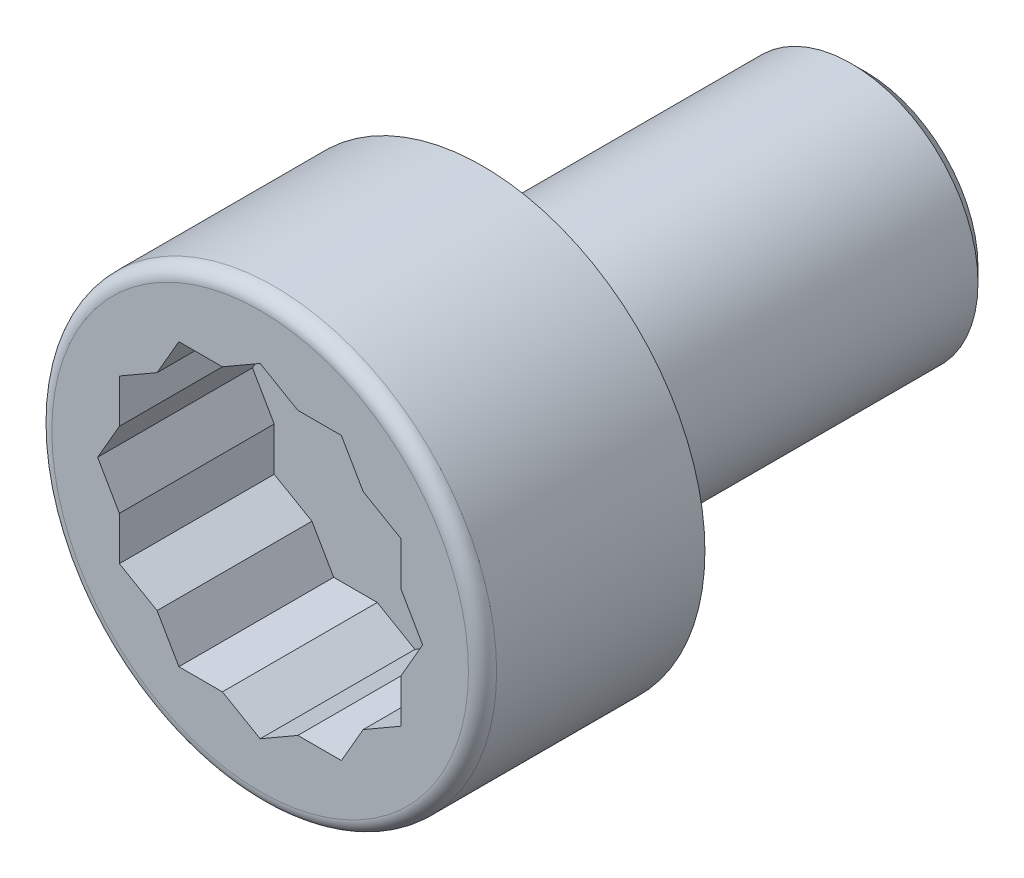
ISO-10303-21;
HEADER;
FILE_DESCRIPTION(('STEP AP214'),'2;1');
FILE_NAME('part.step','',(''),(''),'','','');
FILE_SCHEMA(('AUTOMOTIVE_DESIGN { 1 0 10303 214 1 1 1 1 }'));
ENDSEC;
DATA;
#1=APPLICATION_CONTEXT('core data for automotive mechanical design processes');
#2=APPLICATION_PROTOCOL_DEFINITION('international standard','automotive_design',2000,#1);
#3=PRODUCT_CONTEXT('',#1,'mechanical');
#4=PRODUCT('Part','Part','',(#3));
#5=PRODUCT_RELATED_PRODUCT_CATEGORY('part','',(#4));
#6=PRODUCT_DEFINITION_FORMATION('','',#4);
#7=PRODUCT_DEFINITION_CONTEXT('part definition',#1,'design');
#8=PRODUCT_DEFINITION('design','',#6,#7);
#9=PRODUCT_DEFINITION_SHAPE('','',#8);
#10=(LENGTH_UNIT() NAMED_UNIT(*) SI_UNIT(.MILLI.,.METRE.));
#11=(NAMED_UNIT(*) PLANE_ANGLE_UNIT() SI_UNIT($,.RADIAN.));
#12=(NAMED_UNIT(*) SI_UNIT($,.STERADIAN.) SOLID_ANGLE_UNIT());
#13=UNCERTAINTY_MEASURE_WITH_UNIT(LENGTH_MEASURE(1.E-05),#10,'distance_accuracy_value','');
#14=(GEOMETRIC_REPRESENTATION_CONTEXT(3) GLOBAL_UNCERTAINTY_ASSIGNED_CONTEXT((#13)) GLOBAL_UNIT_ASSIGNED_CONTEXT((#10,
#11,#12)) REPRESENTATION_CONTEXT('',''));
#15=CARTESIAN_POINT('',(0.,0.,0.));
#16=DIRECTION('',(0.,0.,1.));
#17=DIRECTION('',(1.,0.,0.));
#18=AXIS2_PLACEMENT_3D('',#15,#16,#17);
#19=CARTESIAN_POINT('',(5.,2.88675134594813,-5.5));
#20=DIRECTION('',(0.5,0.866025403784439,0.));
#21=DIRECTION('',(-0.866025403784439,0.5,0.));
#22=AXIS2_PLACEMENT_3D('',#19,#20,#21);
#23=PLANE('',#22);
#24=DIRECTION('',(-0.866025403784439,0.5,0.));
#25=VECTOR('',#24,1.);
#26=CARTESIAN_POINT('',(5.,2.88675134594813,-5.5));
#27=LINE('',#26,#25);
#28=CARTESIAN_POINT('',(1.3397459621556,5.,-5.5));
#29=VERTEX_POINT('',#28);
#30=CARTESIAN_POINT('',(0.,5.77350269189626,-5.5));
#31=VERTEX_POINT('',#30);
#32=EDGE_CURVE('E317',#29,#31,#27,.T.);
#33=ORIENTED_EDGE('',*,*,#32,.F.);
#34=DIRECTION('',(0.,0.,1.));
#35=VECTOR('',#34,1.);
#36=CARTESIAN_POINT('',(1.33974596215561,5.,-5.5));
#37=LINE('',#36,#35);
#38=CARTESIAN_POINT('',(1.33974596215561,5.,0.));
#39=VERTEX_POINT('',#38);
#40=EDGE_CURVE('E292',#29,#39,#37,.T.);
#41=ORIENTED_EDGE('',*,*,#40,.T.);
#42=DIRECTION('',(-0.866025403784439,0.5,0.));
#43=VECTOR('',#42,1.);
#44=CARTESIAN_POINT('',(5.,2.88675134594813,0.));
#45=LINE('',#44,#43);
#46=CARTESIAN_POINT('',(0.,5.77350269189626,0.));
#47=VERTEX_POINT('',#46);
#48=EDGE_CURVE('E295',#39,#47,#45,.T.);
#49=ORIENTED_EDGE('',*,*,#48,.T.);
#50=DIRECTION('',(0.,0.,1.));
#51=VECTOR('',#50,1.);
#52=CARTESIAN_POINT('',(0.,5.77350269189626,-5.5));
#53=LINE('',#52,#51);
#54=EDGE_CURVE('E341',#31,#47,#53,.T.);
#55=ORIENTED_EDGE('',*,*,#54,.F.);
#56=EDGE_LOOP('',(#33,#41,#49,#55));
#57=FACE_BOUND('',#56,.T.);
#58=ADVANCED_FACE('F31',(#57),#23,.F.);
#59=CARTESIAN_POINT('',(5.,-2.88675134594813,-5.5));
#60=DIRECTION('',(1.,0.,0.));
#61=DIRECTION('',(0.,1.,0.));
#62=AXIS2_PLACEMENT_3D('',#59,#60,#61);
#63=PLANE('',#62);
#64=DIRECTION('',(0.,1.,0.));
#65=VECTOR('',#64,1.);
#66=CARTESIAN_POINT('',(5.,-2.88675134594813,-5.5));
#67=LINE('',#66,#65);
#68=CARTESIAN_POINT('',(4.99999999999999,1.33974596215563,-5.5));
#69=VERTEX_POINT('',#68);
#70=CARTESIAN_POINT('',(5.,2.88675134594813,-5.5));
#71=VERTEX_POINT('',#70);
#72=EDGE_CURVE('E337',#69,#71,#67,.T.);
#73=ORIENTED_EDGE('',*,*,#72,.F.);
#74=DIRECTION('',(0.,0.,1.));
#75=VECTOR('',#74,1.);
#76=CARTESIAN_POINT('',(5.,1.33974596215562,-5.5));
#77=LINE('',#76,#75);
#78=CARTESIAN_POINT('',(5.,1.33974596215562,0.));
#79=VERTEX_POINT('',#78);
#80=EDGE_CURVE('E285',#69,#79,#77,.T.);
#81=ORIENTED_EDGE('',*,*,#80,.T.);
#82=DIRECTION('',(0.,1.,0.));
#83=VECTOR('',#82,1.);
#84=CARTESIAN_POINT('',(5.,-2.88675134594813,0.));
#85=LINE('',#84,#83);
#86=CARTESIAN_POINT('',(5.,2.88675134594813,0.));
#87=VERTEX_POINT('',#86);
#88=EDGE_CURVE('E313',#79,#87,#85,.T.);
#89=ORIENTED_EDGE('',*,*,#88,.T.);
#90=DIRECTION('',(0.,0.,1.));
#91=VECTOR('',#90,1.);
#92=CARTESIAN_POINT('',(5.,2.88675134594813,-5.5));
#93=LINE('',#92,#91);
#94=EDGE_CURVE('E342',#71,#87,#93,.T.);
#95=ORIENTED_EDGE('',*,*,#94,.F.);
#96=EDGE_LOOP('',(#73,#81,#89,#95));
#97=FACE_BOUND('',#96,.T.);
#98=ADVANCED_FACE('F390',(#97),#63,.F.);
#99=CARTESIAN_POINT('',(0.,-5.77350269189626,-5.5));
#100=DIRECTION('',(0.5,-0.866025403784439,0.));
#101=DIRECTION('',(0.866025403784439,0.5,0.));
#102=AXIS2_PLACEMENT_3D('',#99,#100,#101);
#103=PLANE('',#102);
#104=DIRECTION('',(0.866025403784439,0.5,0.));
#105=VECTOR('',#104,1.);
#106=CARTESIAN_POINT('',(0.,-5.77350269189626,-5.5));
#107=LINE('',#106,#105);
#108=CARTESIAN_POINT('',(3.66025403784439,-3.66025403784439,-5.5));
#109=VERTEX_POINT('',#108);
#110=CARTESIAN_POINT('',(5.,-2.88675134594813,-5.5));
#111=VERTEX_POINT('',#110);
#112=EDGE_CURVE('E333',#109,#111,#107,.T.);
#113=ORIENTED_EDGE('',*,*,#112,.F.);
#114=DIRECTION('',(0.,0.,1.));
#115=VECTOR('',#114,1.);
#116=CARTESIAN_POINT('',(3.66025403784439,-3.66025403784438,-5.5));
#117=LINE('',#116,#115);
#118=CARTESIAN_POINT('',(3.66025403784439,-3.66025403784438,0.));
#119=VERTEX_POINT('',#118);
#120=EDGE_CURVE('E279',#109,#119,#117,.T.);
#121=ORIENTED_EDGE('',*,*,#120,.T.);
#122=DIRECTION('',(0.866025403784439,0.5,0.));
#123=VECTOR('',#122,1.);
#124=CARTESIAN_POINT('',(0.,-5.77350269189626,0.));
#125=LINE('',#124,#123);
#126=CARTESIAN_POINT('',(5.,-2.88675134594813,0.));
#127=VERTEX_POINT('',#126);
#128=EDGE_CURVE('E309',#119,#127,#125,.T.);
#129=ORIENTED_EDGE('',*,*,#128,.T.);
#130=DIRECTION('',(0.,0.,1.));
#131=VECTOR('',#130,1.);
#132=CARTESIAN_POINT('',(5.,-2.88675134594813,-5.5));
#133=LINE('',#132,#131);
#134=EDGE_CURVE('E346',#111,#127,#133,.T.);
#135=ORIENTED_EDGE('',*,*,#134,.F.);
#136=EDGE_LOOP('',(#113,#121,#129,#135));
#137=FACE_BOUND('',#136,.T.);
#138=ADVANCED_FACE('F397',(#137),#103,.F.);
#139=CARTESIAN_POINT('',(-5.,-2.88675134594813,-5.5));
#140=DIRECTION('',(-0.5,-0.866025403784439,0.));
#141=DIRECTION('',(0.866025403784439,-0.5,0.));
#142=AXIS2_PLACEMENT_3D('',#139,#140,#141);
#143=PLANE('',#142);
#144=DIRECTION('',(0.866025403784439,-0.5,0.));
#145=VECTOR('',#144,1.);
#146=CARTESIAN_POINT('',(-5.,-2.88675134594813,-5.5));
#147=LINE('',#146,#145);
#148=CARTESIAN_POINT('',(-1.33974596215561,-5.,-5.5));
#149=VERTEX_POINT('',#148);
#150=CARTESIAN_POINT('',(0.,-5.77350269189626,-5.5));
#151=VERTEX_POINT('',#150);
#152=EDGE_CURVE('E329',#149,#151,#147,.T.);
#153=ORIENTED_EDGE('',*,*,#152,.F.);
#154=DIRECTION('',(0.,0.,1.));
#155=VECTOR('',#154,1.);
#156=CARTESIAN_POINT('',(-1.33974596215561,-5.,-5.5));
#157=LINE('',#156,#155);
#158=CARTESIAN_POINT('',(-1.33974596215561,-5.,0.));
#159=VERTEX_POINT('',#158);
#160=EDGE_CURVE('E273',#149,#159,#157,.T.);
#161=ORIENTED_EDGE('',*,*,#160,.T.);
#162=DIRECTION('',(0.866025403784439,-0.5,0.));
#163=VECTOR('',#162,1.);
#164=CARTESIAN_POINT('',(-5.,-2.88675134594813,0.));
#165=LINE('',#164,#163);
#166=CARTESIAN_POINT('',(0.,-5.77350269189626,0.));
#167=VERTEX_POINT('',#166);
#168=EDGE_CURVE('E305',#159,#167,#165,.T.);
#169=ORIENTED_EDGE('',*,*,#168,.T.);
#170=DIRECTION('',(0.,0.,1.));
#171=VECTOR('',#170,1.);
#172=CARTESIAN_POINT('',(0.,-5.77350269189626,-5.5));
#173=LINE('',#172,#171);
#174=EDGE_CURVE('E349',#151,#167,#173,.T.);
#175=ORIENTED_EDGE('',*,*,#174,.F.);
#176=EDGE_LOOP('',(#153,#161,#169,#175));
#177=FACE_BOUND('',#176,.T.);
#178=ADVANCED_FACE('F458',(#177),#143,.F.);
#179=CARTESIAN_POINT('',(-5.,2.88675134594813,-5.5));
#180=DIRECTION('',(-1.,0.,0.));
#181=DIRECTION('',(0.,-1.,0.));
#182=AXIS2_PLACEMENT_3D('',#179,#180,#181);
#183=PLANE('',#182);
#184=DIRECTION('',(0.,-1.,0.));
#185=VECTOR('',#184,1.);
#186=CARTESIAN_POINT('',(-5.,2.88675134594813,-5.5));
#187=LINE('',#186,#185);
#188=CARTESIAN_POINT('',(-5.,-1.33974596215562,-5.5));
#189=VERTEX_POINT('',#188);
#190=CARTESIAN_POINT('',(-5.,-2.88675134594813,-5.5));
#191=VERTEX_POINT('',#190);
#192=EDGE_CURVE('E325',#189,#191,#187,.T.);
#193=ORIENTED_EDGE('',*,*,#192,.F.);
#194=DIRECTION('',(0.,0.,1.));
#195=VECTOR('',#194,1.);
#196=CARTESIAN_POINT('',(-5.,-1.33974596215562,-5.5));
#197=LINE('',#196,#195);
#198=CARTESIAN_POINT('',(-5.,-1.33974596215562,0.));
#199=VERTEX_POINT('',#198);
#200=EDGE_CURVE('E267',#189,#199,#197,.T.);
#201=ORIENTED_EDGE('',*,*,#200,.T.);
#202=DIRECTION('',(0.,-1.,0.));
#203=VECTOR('',#202,1.);
#204=CARTESIAN_POINT('',(-5.,2.88675134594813,0.));
#205=LINE('',#204,#203);
#206=CARTESIAN_POINT('',(-5.,-2.88675134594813,0.));
#207=VERTEX_POINT('',#206);
#208=EDGE_CURVE('E301',#199,#207,#205,.T.);
#209=ORIENTED_EDGE('',*,*,#208,.T.);
#210=DIRECTION('',(0.,0.,1.));
#211=VECTOR('',#210,1.);
#212=CARTESIAN_POINT('',(-5.,-2.88675134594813,-5.5));
#213=LINE('',#212,#211);
#214=EDGE_CURVE('E352',#191,#207,#213,.T.);
#215=ORIENTED_EDGE('',*,*,#214,.F.);
#216=EDGE_LOOP('',(#193,#201,#209,#215));
#217=FACE_BOUND('',#216,.T.);
#218=ADVANCED_FACE('F476',(#217),#183,.F.);
#219=CARTESIAN_POINT('',(0.,5.77350269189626,-5.5));
#220=DIRECTION('',(-0.5,0.866025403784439,0.));
#221=DIRECTION('',(-0.866025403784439,-0.5,0.));
#222=AXIS2_PLACEMENT_3D('',#219,#220,#221);
#223=PLANE('',#222);
#224=DIRECTION('',(-0.866025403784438,-0.5,0.));
#225=VECTOR('',#224,1.);
#226=CARTESIAN_POINT('',(0.,5.77350269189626,0.));
#227=LINE('',#226,#225);
#228=CARTESIAN_POINT('',(-1.33974596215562,5.,0.));
#229=VERTEX_POINT('',#228);
#230=EDGE_CURVE('E299',#47,#229,#227,.T.);
#231=ORIENTED_EDGE('',*,*,#230,.T.);
#232=DIRECTION('',(0.,0.,-1.));
#233=VECTOR('',#232,1.);
#234=CARTESIAN_POINT('',(-1.33974596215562,5.,-5.5));
#235=LINE('',#234,#233);
#236=CARTESIAN_POINT('',(-1.33974596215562,5.,-5.5));
#237=VERTEX_POINT('',#236);
#238=EDGE_CURVE('E197',#229,#237,#235,.T.);
#239=ORIENTED_EDGE('',*,*,#238,.T.);
#240=DIRECTION('',(-0.866025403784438,-0.5,0.));
#241=VECTOR('',#240,1.);
#242=CARTESIAN_POINT('',(0.,5.77350269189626,-5.5));
#243=LINE('',#242,#241);
#244=EDGE_CURVE('E322',#31,#237,#243,.T.);
#245=ORIENTED_EDGE('',*,*,#244,.F.);
#246=ORIENTED_EDGE('',*,*,#54,.T.);
#247=EDGE_LOOP('',(#231,#239,#245,#246));
#248=FACE_BOUND('',#247,.T.);
#249=ADVANCED_FACE('F493',(#248),#223,.F.);
#250=CARTESIAN_POINT('',(0.,7.89999999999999,0.));
#251=DIRECTION('',(0.,0.,-1.));
#252=DIRECTION('',(-1.,0.,0.));
#253=AXIS2_PLACEMENT_3D('',#250,#251,#252);
#254=PLANE('',#253);
#255=CARTESIAN_POINT('',(0.,0.,0.));
#256=DIRECTION('',(0.,0.,-1.));
#257=DIRECTION('',(-1.,0.,0.));
#258=AXIS2_PLACEMENT_3D('',#255,#256,#257);
#259=CIRCLE('',#258,7.4);
#260=CARTESIAN_POINT('',(-7.4,0.,0.));
#261=VERTEX_POINT('',#260);
#262=EDGE_CURVE('E39',#261,#261,#259,.F.);
#263=ORIENTED_EDGE('',*,*,#262,.T.);
#264=EDGE_LOOP('',(#263));
#265=FACE_BOUND('',#264,.T.);
#266=ORIENTED_EDGE('',*,*,#48,.F.);
#267=DIRECTION('',(-1.,0.,0.));
#268=VECTOR('',#267,1.);
#269=CARTESIAN_POINT('',(2.88675134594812,5.,0.));
#270=LINE('',#269,#268);
#271=CARTESIAN_POINT('',(2.88675134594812,5.,0.));
#272=VERTEX_POINT('',#271);
#273=EDGE_CURVE('E202',#272,#39,#270,.T.);
#274=ORIENTED_EDGE('',*,*,#273,.F.);
#275=DIRECTION('',(-0.500000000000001,0.866025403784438,0.));
#276=VECTOR('',#275,1.);
#277=CARTESIAN_POINT('',(5.77350269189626,0.,0.));
#278=LINE('',#277,#276);
#279=CARTESIAN_POINT('',(3.66025403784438,3.66025403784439,0.));
#280=VERTEX_POINT('',#279);
#281=EDGE_CURVE('E230',#280,#272,#278,.T.);
#282=ORIENTED_EDGE('',*,*,#281,.F.);
#283=EDGE_CURVE('E296',#87,#280,#45,.T.);
#284=ORIENTED_EDGE('',*,*,#283,.F.);
#285=ORIENTED_EDGE('',*,*,#88,.F.);
#286=CARTESIAN_POINT('',(5.77350269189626,0.,0.));
#287=VERTEX_POINT('',#286);
#288=EDGE_CURVE('E231',#287,#79,#278,.T.);
#289=ORIENTED_EDGE('',*,*,#288,.F.);
#290=DIRECTION('',(0.499999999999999,0.866025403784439,0.));
#291=VECTOR('',#290,1.);
#292=CARTESIAN_POINT('',(2.88675134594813,-5.,0.));
#293=LINE('',#292,#291);
#294=CARTESIAN_POINT('',(5.,-1.33974596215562,0.));
#295=VERTEX_POINT('',#294);
#296=EDGE_CURVE('E227',#295,#287,#293,.T.);
#297=ORIENTED_EDGE('',*,*,#296,.F.);
#298=EDGE_CURVE('E314',#127,#295,#85,.T.);
#299=ORIENTED_EDGE('',*,*,#298,.F.);
#300=ORIENTED_EDGE('',*,*,#128,.F.);
#301=CARTESIAN_POINT('',(2.88675134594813,-5.,0.));
#302=VERTEX_POINT('',#301);
#303=EDGE_CURVE('E228',#302,#119,#293,.T.);
#304=ORIENTED_EDGE('',*,*,#303,.F.);
#305=DIRECTION('',(1.,0.,0.));
#306=VECTOR('',#305,1.);
#307=CARTESIAN_POINT('',(-2.88675134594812,-5.,0.));
#308=LINE('',#307,#306);
#309=CARTESIAN_POINT('',(1.33974596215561,-5.,0.));
#310=VERTEX_POINT('',#309);
#311=EDGE_CURVE('E224',#310,#302,#308,.T.);
#312=ORIENTED_EDGE('',*,*,#311,.F.);
#313=EDGE_CURVE('E310',#167,#310,#125,.T.);
#314=ORIENTED_EDGE('',*,*,#313,.F.);
#315=ORIENTED_EDGE('',*,*,#168,.F.);
#316=CARTESIAN_POINT('',(-2.88675134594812,-5.,0.));
#317=VERTEX_POINT('',#316);
#318=EDGE_CURVE('E225',#317,#159,#308,.T.);
#319=ORIENTED_EDGE('',*,*,#318,.F.);
#320=DIRECTION('',(0.500000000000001,-0.866025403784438,0.));
#321=VECTOR('',#320,1.);
#322=CARTESIAN_POINT('',(-5.77350269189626,0.,0.));
#323=LINE('',#322,#321);
#324=CARTESIAN_POINT('',(-3.66025403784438,-3.66025403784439,0.));
#325=VERTEX_POINT('',#324);
#326=EDGE_CURVE('E217',#325,#317,#323,.T.);
#327=ORIENTED_EDGE('',*,*,#326,.F.);
#328=EDGE_CURVE('E306',#207,#325,#165,.T.);
#329=ORIENTED_EDGE('',*,*,#328,.F.);
#330=ORIENTED_EDGE('',*,*,#208,.F.);
#331=CARTESIAN_POINT('',(-5.77350269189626,0.,0.));
#332=VERTEX_POINT('',#331);
#333=EDGE_CURVE('E220',#332,#199,#323,.T.);
#334=ORIENTED_EDGE('',*,*,#333,.F.);
#335=DIRECTION('',(-0.499999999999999,-0.866025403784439,0.));
#336=VECTOR('',#335,1.);
#337=CARTESIAN_POINT('',(-2.88675134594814,5.,0.));
#338=LINE('',#337,#336);
#339=CARTESIAN_POINT('',(-5.,1.33974596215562,0.));
#340=VERTEX_POINT('',#339);
#341=EDGE_CURVE('E218',#340,#332,#338,.T.);
#342=ORIENTED_EDGE('',*,*,#341,.F.);
#343=CARTESIAN_POINT('',(-5.,2.88675134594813,0.));
#344=VERTEX_POINT('',#343);
#345=EDGE_CURVE('E302',#344,#340,#205,.T.);
#346=ORIENTED_EDGE('',*,*,#345,.F.);
#347=CARTESIAN_POINT('',(-3.66025403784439,3.66025403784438,0.));
#348=VERTEX_POINT('',#347);
#349=EDGE_CURVE('E216',#348,#344,#227,.T.);
#350=ORIENTED_EDGE('',*,*,#349,.F.);
#351=CARTESIAN_POINT('',(-2.88675134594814,5.,0.));
#352=VERTEX_POINT('',#351);
#353=EDGE_CURVE('E208',#352,#348,#338,.T.);
#354=ORIENTED_EDGE('',*,*,#353,.F.);
#355=EDGE_CURVE('E191',#229,#352,#270,.T.);
#356=ORIENTED_EDGE('',*,*,#355,.F.);
#357=ORIENTED_EDGE('',*,*,#230,.F.);
#358=EDGE_LOOP('',(#266,#274,#282,#284,#285,#289,#297,#299,#300,#304,#312,#314,#315,#319,#327,
#329,#330,#334,#342,#346,#350,#354,#356,#357));
#359=FACE_BOUND('',#358,.T.);
#360=ADVANCED_FACE('F33',(#265,#359),#254,.F.);
#361=CARTESIAN_POINT('',(0.,0.,0.));
#362=DIRECTION('',(0.,0.,1.));
#363=DIRECTION('',(1.,0.,0.));
#364=AXIS2_PLACEMENT_3D('',#361,#362,#363);
#365=CYLINDRICAL_SURFACE('',#364,7.9);
#366=CARTESIAN_POINT('',(0.,0.,-0.500000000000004));
#367=DIRECTION('',(0.,0.,-1.));
#368=DIRECTION('',(-1.,0.,0.));
#369=AXIS2_PLACEMENT_3D('',#366,#367,#368);
#370=CIRCLE('',#369,7.9);
#371=CARTESIAN_POINT('',(-7.9,0.,-0.500000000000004));
#372=VERTEX_POINT('',#371);
#373=EDGE_CURVE('E11',#372,#372,#370,.T.);
#374=ORIENTED_EDGE('',*,*,#373,.T.);
#375=EDGE_LOOP('',(#374));
#376=FACE_BOUND('',#375,.T.);
#377=CARTESIAN_POINT('',(0.,0.,-7.9));
#378=DIRECTION('',(0.,0.,1.));
#379=DIRECTION('',(1.,0.,0.));
#380=AXIS2_PLACEMENT_3D('',#377,#378,#379);
#381=CIRCLE('',#380,7.9);
#382=CARTESIAN_POINT('',(7.9,0.,-7.9));
#383=VERTEX_POINT('',#382);
#384=EDGE_CURVE('E362',#383,#383,#381,.T.);
#385=ORIENTED_EDGE('',*,*,#384,.T.);
#386=EDGE_LOOP('',(#385));
#387=FACE_BOUND('',#386,.T.);
#388=ADVANCED_FACE('F507',(#376,#387),#365,.T.);
#389=CARTESIAN_POINT('',(0.,4.5,-7.9));
#390=DIRECTION('',(0.,0.,1.));
#391=DIRECTION('',(1.,0.,0.));
#392=AXIS2_PLACEMENT_3D('',#389,#390,#391);
#393=PLANE('',#392);
#394=ORIENTED_EDGE('',*,*,#384,.F.);
#395=EDGE_LOOP('',(#394));
#396=FACE_BOUND('',#395,.T.);
#397=CARTESIAN_POINT('',(0.,0.,-7.9));
#398=DIRECTION('',(0.,0.,1.));
#399=DIRECTION('',(1.,0.,0.));
#400=AXIS2_PLACEMENT_3D('',#397,#398,#399);
#401=CIRCLE('',#400,4.5);
#402=CARTESIAN_POINT('',(4.5,0.,-7.9));
#403=VERTEX_POINT('',#402);
#404=EDGE_CURVE('E345',#403,#403,#401,.T.);
#405=ORIENTED_EDGE('',*,*,#404,.T.);
#406=EDGE_LOOP('',(#405));
#407=FACE_BOUND('',#406,.T.);
#408=ADVANCED_FACE('F565',(#396,#407),#393,.F.);
#409=CARTESIAN_POINT('',(0.,0.,0.));
#410=DIRECTION('',(0.,0.,1.));
#411=DIRECTION('',(1.,0.,0.));
#412=AXIS2_PLACEMENT_3D('',#409,#410,#411);
#413=CYLINDRICAL_SURFACE('',#412,4.5);
#414=CARTESIAN_POINT('',(0.,0.,-21.));
#415=DIRECTION('',(0.,0.,1.));
#416=DIRECTION('',(1.,0.,0.));
#417=AXIS2_PLACEMENT_3D('',#414,#415,#416);
#418=CIRCLE('',#417,4.5);
#419=CARTESIAN_POINT('',(4.5,0.,-21.));
#420=VERTEX_POINT('',#419);
#421=EDGE_CURVE('E365',#420,#420,#418,.T.);
#422=ORIENTED_EDGE('',*,*,#421,.T.);
#423=EDGE_LOOP('',(#422));
#424=FACE_BOUND('',#423,.T.);
#425=ORIENTED_EDGE('',*,*,#404,.F.);
#426=EDGE_LOOP('',(#425));
#427=FACE_BOUND('',#426,.T.);
#428=ADVANCED_FACE('F413',(#424,#427),#413,.T.);
#429=CARTESIAN_POINT('',(0.,0.,-21.5));
#430=DIRECTION('',(0.,0.,1.));
#431=DIRECTION('',(1.,0.,0.));
#432=AXIS2_PLACEMENT_3D('',#429,#430,#431);
#433=PLANE('',#432);
#434=CARTESIAN_POINT('',(0.,0.,-21.5));
#435=DIRECTION('',(0.,0.,1.));
#436=DIRECTION('',(1.,0.,0.));
#437=AXIS2_PLACEMENT_3D('',#434,#435,#436);
#438=CIRCLE('',#437,4.);
#439=CARTESIAN_POINT('',(4.,0.,-21.5));
#440=VERTEX_POINT('',#439);
#441=EDGE_CURVE('E371',#440,#440,#438,.F.);
#442=ORIENTED_EDGE('',*,*,#441,.T.);
#443=EDGE_LOOP('',(#442));
#444=FACE_BOUND('',#443,.T.);
#445=CARTESIAN_POINT('',(0.,0.,-21.5));
#446=DIRECTION('',(0.,0.,1.));
#447=DIRECTION('',(1.,0.,0.));
#448=AXIS2_PLACEMENT_3D('',#445,#446,#447);
#449=CIRCLE('',#448,2.5);
#450=CARTESIAN_POINT('',(2.5,0.,-21.5));
#451=VERTEX_POINT('',#450);
#452=EDGE_CURVE('E368',#451,#451,#449,.T.);
#453=ORIENTED_EDGE('',*,*,#452,.T.);
#454=EDGE_LOOP('',(#453));
#455=FACE_BOUND('',#454,.T.);
#456=ADVANCED_FACE('F405',(#444,#455),#433,.F.);
#457=ORIENTED_EDGE('',*,*,#283,.T.);
#458=DIRECTION('',(0.,0.,-1.));
#459=VECTOR('',#458,1.);
#460=CARTESIAN_POINT('',(3.66025403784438,3.66025403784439,-5.5));
#461=LINE('',#460,#459);
#462=CARTESIAN_POINT('',(3.66025403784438,3.6602540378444,-5.5));
#463=VERTEX_POINT('',#462);
#464=EDGE_CURVE('E288',#280,#463,#461,.T.);
#465=ORIENTED_EDGE('',*,*,#464,.T.);
#466=EDGE_CURVE('E318',#71,#463,#27,.T.);
#467=ORIENTED_EDGE('',*,*,#466,.F.);
#468=ORIENTED_EDGE('',*,*,#94,.T.);
#469=EDGE_LOOP('',(#457,#465,#467,#468));
#470=FACE_BOUND('',#469,.T.);
#471=ADVANCED_FACE('F393',(#470),#23,.F.);
#472=ORIENTED_EDGE('',*,*,#298,.T.);
#473=DIRECTION('',(0.,0.,-1.));
#474=VECTOR('',#473,1.);
#475=CARTESIAN_POINT('',(5.,-1.33974596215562,-5.5));
#476=LINE('',#475,#474);
#477=CARTESIAN_POINT('',(5.,-1.33974596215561,-5.5));
#478=VERTEX_POINT('',#477);
#479=EDGE_CURVE('E282',#295,#478,#476,.T.);
#480=ORIENTED_EDGE('',*,*,#479,.T.);
#481=EDGE_CURVE('E338',#111,#478,#67,.T.);
#482=ORIENTED_EDGE('',*,*,#481,.F.);
#483=ORIENTED_EDGE('',*,*,#134,.T.);
#484=EDGE_LOOP('',(#472,#480,#482,#483));
#485=FACE_BOUND('',#484,.T.);
#486=ADVANCED_FACE('F400',(#485),#63,.F.);
#487=ORIENTED_EDGE('',*,*,#313,.T.);
#488=DIRECTION('',(0.,0.,-1.));
#489=VECTOR('',#488,1.);
#490=CARTESIAN_POINT('',(1.33974596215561,-5.,-5.5));
#491=LINE('',#490,#489);
#492=CARTESIAN_POINT('',(1.33974596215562,-5.,-5.5));
#493=VERTEX_POINT('',#492);
#494=EDGE_CURVE('E276',#310,#493,#491,.T.);
#495=ORIENTED_EDGE('',*,*,#494,.T.);
#496=EDGE_CURVE('E334',#151,#493,#107,.T.);
#497=ORIENTED_EDGE('',*,*,#496,.F.);
#498=ORIENTED_EDGE('',*,*,#174,.T.);
#499=EDGE_LOOP('',(#487,#495,#497,#498));
#500=FACE_BOUND('',#499,.T.);
#501=ADVANCED_FACE('F411',(#500),#103,.F.);
#502=ORIENTED_EDGE('',*,*,#328,.T.);
#503=DIRECTION('',(0.,0.,-1.));
#504=VECTOR('',#503,1.);
#505=CARTESIAN_POINT('',(-3.66025403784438,-3.66025403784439,-5.5));
#506=LINE('',#505,#504);
#507=CARTESIAN_POINT('',(-3.66025403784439,-3.66025403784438,-5.5));
#508=VERTEX_POINT('',#507);
#509=EDGE_CURVE('E270',#325,#508,#506,.T.);
#510=ORIENTED_EDGE('',*,*,#509,.T.);
#511=EDGE_CURVE('E330',#191,#508,#147,.T.);
#512=ORIENTED_EDGE('',*,*,#511,.F.);
#513=ORIENTED_EDGE('',*,*,#214,.T.);
#514=EDGE_LOOP('',(#502,#510,#512,#513));
#515=FACE_BOUND('',#514,.T.);
#516=ADVANCED_FACE('F470',(#515),#143,.F.);
#517=ORIENTED_EDGE('',*,*,#345,.T.);
#518=DIRECTION('',(0.,0.,-1.));
#519=VECTOR('',#518,1.);
#520=CARTESIAN_POINT('',(-5.,1.33974596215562,-5.5));
#521=LINE('',#520,#519);
#522=CARTESIAN_POINT('',(-5.,1.33974596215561,-5.5));
#523=VERTEX_POINT('',#522);
#524=EDGE_CURVE('E264',#340,#523,#521,.T.);
#525=ORIENTED_EDGE('',*,*,#524,.T.);
#526=CARTESIAN_POINT('',(-5.,2.88675134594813,-5.5));
#527=VERTEX_POINT('',#526);
#528=EDGE_CURVE('E326',#527,#523,#187,.T.);
#529=ORIENTED_EDGE('',*,*,#528,.F.);
#530=DIRECTION('',(0.,0.,1.));
#531=VECTOR('',#530,1.);
#532=CARTESIAN_POINT('',(-5.,2.88675134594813,-5.5));
#533=LINE('',#532,#531);
#534=EDGE_CURVE('E355',#527,#344,#533,.T.);
#535=ORIENTED_EDGE('',*,*,#534,.T.);
#536=EDGE_LOOP('',(#517,#525,#529,#535));
#537=FACE_BOUND('',#536,.T.);
#538=ADVANCED_FACE('F487',(#537),#183,.F.);
#539=CARTESIAN_POINT('',(-3.66025403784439,3.66025403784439,-5.5));
#540=VERTEX_POINT('',#539);
#541=EDGE_CURVE('E321',#540,#527,#243,.T.);
#542=ORIENTED_EDGE('',*,*,#541,.F.);
#543=DIRECTION('',(0.,0.,1.));
#544=VECTOR('',#543,1.);
#545=CARTESIAN_POINT('',(-3.66025403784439,3.66025403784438,-5.5));
#546=LINE('',#545,#544);
#547=EDGE_CURVE('E251',#540,#348,#546,.T.);
#548=ORIENTED_EDGE('',*,*,#547,.T.);
#549=ORIENTED_EDGE('',*,*,#349,.T.);
#550=ORIENTED_EDGE('',*,*,#534,.F.);
#551=EDGE_LOOP('',(#542,#548,#549,#550));
#552=FACE_BOUND('',#551,.T.);
#553=ADVANCED_FACE('F491',(#552),#223,.F.);
#554=CARTESIAN_POINT('',(-5.,8.66025403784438,-5.5));
#555=DIRECTION('',(0.,0.,1.));
#556=DIRECTION('',(1.,0.,0.));
#557=AXIS2_PLACEMENT_3D('',#554,#555,#556);
#558=PLANE('',#557);
#559=CARTESIAN_POINT('',(0.,0.,-5.5));
#560=DIRECTION('',(0.,0.,1.));
#561=DIRECTION('',(1.,0.,0.));
#562=AXIS2_PLACEMENT_3D('',#559,#560,#561);
#563=CIRCLE('',#562,2.49999999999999);
#564=CARTESIAN_POINT('',(2.49999999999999,0.,-5.5));
#565=VERTEX_POINT('',#564);
#566=EDGE_CURVE('E203',#565,#565,#563,.T.);
#567=ORIENTED_EDGE('',*,*,#566,.F.);
#568=EDGE_LOOP('',(#567));
#569=FACE_BOUND('',#568,.T.);
#570=ORIENTED_EDGE('',*,*,#528,.T.);
#571=DIRECTION('',(-0.499999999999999,-0.866025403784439,0.));
#572=VECTOR('',#571,1.);
#573=CARTESIAN_POINT('',(-2.88675134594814,5.,-5.5));
#574=LINE('',#573,#572);
#575=CARTESIAN_POINT('',(-5.77350269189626,0.,-5.5));
#576=VERTEX_POINT('',#575);
#577=EDGE_CURVE('E236',#523,#576,#574,.T.);
#578=ORIENTED_EDGE('',*,*,#577,.T.);
#579=DIRECTION('',(0.500000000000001,-0.866025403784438,0.));
#580=VECTOR('',#579,1.);
#581=CARTESIAN_POINT('',(-5.77350269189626,0.,-5.5));
#582=LINE('',#581,#580);
#583=EDGE_CURVE('E239',#576,#189,#582,.T.);
#584=ORIENTED_EDGE('',*,*,#583,.T.);
#585=ORIENTED_EDGE('',*,*,#192,.T.);
#586=ORIENTED_EDGE('',*,*,#511,.T.);
#587=CARTESIAN_POINT('',(-2.88675134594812,-5.,-5.5));
#588=VERTEX_POINT('',#587);
#589=EDGE_CURVE('E238',#508,#588,#582,.T.);
#590=ORIENTED_EDGE('',*,*,#589,.T.);
#591=DIRECTION('',(1.,0.,0.));
#592=VECTOR('',#591,1.);
#593=CARTESIAN_POINT('',(-2.88675134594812,-5.,-5.5));
#594=LINE('',#593,#592);
#595=EDGE_CURVE('E242',#588,#149,#594,.T.);
#596=ORIENTED_EDGE('',*,*,#595,.T.);
#597=ORIENTED_EDGE('',*,*,#152,.T.);
#598=ORIENTED_EDGE('',*,*,#496,.T.);
#599=CARTESIAN_POINT('',(2.88675134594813,-5.,-5.5));
#600=VERTEX_POINT('',#599);
#601=EDGE_CURVE('E241',#493,#600,#594,.T.);
#602=ORIENTED_EDGE('',*,*,#601,.T.);
#603=DIRECTION('',(0.499999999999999,0.866025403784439,0.));
#604=VECTOR('',#603,1.);
#605=CARTESIAN_POINT('',(2.88675134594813,-5.,-5.5));
#606=LINE('',#605,#604);
#607=EDGE_CURVE('E53',#600,#109,#606,.T.);
#608=ORIENTED_EDGE('',*,*,#607,.T.);
#609=ORIENTED_EDGE('',*,*,#112,.T.);
#610=ORIENTED_EDGE('',*,*,#481,.T.);
#611=CARTESIAN_POINT('',(5.77350269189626,0.,-5.5));
#612=VERTEX_POINT('',#611);
#613=EDGE_CURVE('E244',#478,#612,#606,.T.);
#614=ORIENTED_EDGE('',*,*,#613,.T.);
#615=DIRECTION('',(-0.500000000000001,0.866025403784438,0.));
#616=VECTOR('',#615,1.);
#617=CARTESIAN_POINT('',(5.77350269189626,0.,-5.5));
#618=LINE('',#617,#616);
#619=EDGE_CURVE('E46',#612,#69,#618,.T.);
#620=ORIENTED_EDGE('',*,*,#619,.T.);
#621=ORIENTED_EDGE('',*,*,#72,.T.);
#622=ORIENTED_EDGE('',*,*,#466,.T.);
#623=CARTESIAN_POINT('',(2.88675134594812,5.,-5.5));
#624=VERTEX_POINT('',#623);
#625=EDGE_CURVE('E246',#463,#624,#618,.T.);
#626=ORIENTED_EDGE('',*,*,#625,.T.);
#627=DIRECTION('',(-1.,0.,0.));
#628=VECTOR('',#627,1.);
#629=CARTESIAN_POINT('',(2.88675134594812,5.,-5.5));
#630=LINE('',#629,#628);
#631=EDGE_CURVE('E234',#624,#29,#630,.T.);
#632=ORIENTED_EDGE('',*,*,#631,.T.);
#633=ORIENTED_EDGE('',*,*,#32,.T.);
#634=ORIENTED_EDGE('',*,*,#244,.T.);
#635=CARTESIAN_POINT('',(-2.88675134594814,5.,-5.5));
#636=VERTEX_POINT('',#635);
#637=EDGE_CURVE('E233',#237,#636,#630,.T.);
#638=ORIENTED_EDGE('',*,*,#637,.T.);
#639=EDGE_CURVE('E210',#636,#540,#574,.T.);
#640=ORIENTED_EDGE('',*,*,#639,.T.);
#641=ORIENTED_EDGE('',*,*,#541,.T.);
#642=EDGE_LOOP('',(#570,#578,#584,#585,#586,#590,#596,#597,#598,#602,#608,#609,#610,#614,#620,
#621,#622,#626,#632,#633,#634,#638,#640,#641));
#643=FACE_BOUND('',#642,.T.);
#644=ADVANCED_FACE('F429',(#569,#643),#558,.T.);
#645=CARTESIAN_POINT('',(-2.88675134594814,5.,-5.5));
#646=DIRECTION('',(-0.866025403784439,0.499999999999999,0.));
#647=DIRECTION('',(-0.499999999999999,-0.866025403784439,0.));
#648=AXIS2_PLACEMENT_3D('',#645,#646,#647);
#649=PLANE('',#648);
#650=ORIENTED_EDGE('',*,*,#639,.F.);
#651=DIRECTION('',(0.,0.,1.));
#652=VECTOR('',#651,1.);
#653=CARTESIAN_POINT('',(-2.88675134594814,5.,-5.5));
#654=LINE('',#653,#652);
#655=EDGE_CURVE('E194',#636,#352,#654,.T.);
#656=ORIENTED_EDGE('',*,*,#655,.T.);
#657=ORIENTED_EDGE('',*,*,#353,.T.);
#658=ORIENTED_EDGE('',*,*,#547,.F.);
#659=EDGE_LOOP('',(#650,#656,#657,#658));
#660=FACE_BOUND('',#659,.T.);
#661=ADVANCED_FACE('F206',(#660),#649,.F.);
#662=CARTESIAN_POINT('',(2.88675134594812,5.,-5.5));
#663=DIRECTION('',(0.,1.,0.));
#664=DIRECTION('',(-1.,0.,0.));
#665=AXIS2_PLACEMENT_3D('',#662,#663,#664);
#666=PLANE('',#665);
#667=ORIENTED_EDGE('',*,*,#355,.T.);
#668=ORIENTED_EDGE('',*,*,#655,.F.);
#669=ORIENTED_EDGE('',*,*,#637,.F.);
#670=ORIENTED_EDGE('',*,*,#238,.F.);
#671=EDGE_LOOP('',(#667,#668,#669,#670));
#672=FACE_BOUND('',#671,.T.);
#673=ADVANCED_FACE('F193',(#672),#666,.F.);
#674=ORIENTED_EDGE('',*,*,#341,.T.);
#675=DIRECTION('',(0.,0.,1.));
#676=VECTOR('',#675,1.);
#677=CARTESIAN_POINT('',(-5.77350269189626,0.,-5.5));
#678=LINE('',#677,#676);
#679=EDGE_CURVE('E211',#576,#332,#678,.T.);
#680=ORIENTED_EDGE('',*,*,#679,.F.);
#681=ORIENTED_EDGE('',*,*,#577,.F.);
#682=ORIENTED_EDGE('',*,*,#524,.F.);
#683=EDGE_LOOP('',(#674,#680,#681,#682));
#684=FACE_BOUND('',#683,.T.);
#685=ADVANCED_FACE('F484',(#684),#649,.F.);
#686=CARTESIAN_POINT('',(-5.77350269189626,0.,-5.5));
#687=DIRECTION('',(-0.866025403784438,-0.500000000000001,0.));
#688=DIRECTION('',(0.500000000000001,-0.866025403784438,0.));
#689=AXIS2_PLACEMENT_3D('',#686,#687,#688);
#690=PLANE('',#689);
#691=ORIENTED_EDGE('',*,*,#583,.F.);
#692=ORIENTED_EDGE('',*,*,#679,.T.);
#693=ORIENTED_EDGE('',*,*,#333,.T.);
#694=ORIENTED_EDGE('',*,*,#200,.F.);
#695=EDGE_LOOP('',(#691,#692,#693,#694));
#696=FACE_BOUND('',#695,.T.);
#697=ADVANCED_FACE('F481',(#696),#690,.F.);
#698=ORIENTED_EDGE('',*,*,#326,.T.);
#699=DIRECTION('',(0.,0.,1.));
#700=VECTOR('',#699,1.);
#701=CARTESIAN_POINT('',(-2.88675134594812,-5.,-5.5));
#702=LINE('',#701,#700);
#703=EDGE_CURVE('E258',#588,#317,#702,.T.);
#704=ORIENTED_EDGE('',*,*,#703,.F.);
#705=ORIENTED_EDGE('',*,*,#589,.F.);
#706=ORIENTED_EDGE('',*,*,#509,.F.);
#707=EDGE_LOOP('',(#698,#704,#705,#706));
#708=FACE_BOUND('',#707,.T.);
#709=ADVANCED_FACE('F467',(#708),#690,.F.);
#710=CARTESIAN_POINT('',(-2.88675134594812,-5.,-5.5));
#711=DIRECTION('',(0.,-1.,0.));
#712=DIRECTION('',(1.,0.,0.));
#713=AXIS2_PLACEMENT_3D('',#710,#711,#712);
#714=PLANE('',#713);
#715=ORIENTED_EDGE('',*,*,#595,.F.);
#716=ORIENTED_EDGE('',*,*,#703,.T.);
#717=ORIENTED_EDGE('',*,*,#318,.T.);
#718=ORIENTED_EDGE('',*,*,#160,.F.);
#719=EDGE_LOOP('',(#715,#716,#717,#718));
#720=FACE_BOUND('',#719,.T.);
#721=ADVANCED_FACE('F464',(#720),#714,.F.);
#722=ORIENTED_EDGE('',*,*,#311,.T.);
#723=DIRECTION('',(0.,0.,1.));
#724=VECTOR('',#723,1.);
#725=CARTESIAN_POINT('',(2.88675134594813,-5.,-5.5));
#726=LINE('',#725,#724);
#727=EDGE_CURVE('E255',#600,#302,#726,.T.);
#728=ORIENTED_EDGE('',*,*,#727,.F.);
#729=ORIENTED_EDGE('',*,*,#601,.F.);
#730=ORIENTED_EDGE('',*,*,#494,.F.);
#731=EDGE_LOOP('',(#722,#728,#729,#730));
#732=FACE_BOUND('',#731,.T.);
#733=ADVANCED_FACE('F450',(#732),#714,.F.);
#734=CARTESIAN_POINT('',(2.88675134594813,-5.,-5.5));
#735=DIRECTION('',(0.866025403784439,-0.499999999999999,0.));
#736=DIRECTION('',(0.499999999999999,0.866025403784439,0.));
#737=AXIS2_PLACEMENT_3D('',#734,#735,#736);
#738=PLANE('',#737);
#739=ORIENTED_EDGE('',*,*,#607,.F.);
#740=ORIENTED_EDGE('',*,*,#727,.T.);
#741=ORIENTED_EDGE('',*,*,#303,.T.);
#742=ORIENTED_EDGE('',*,*,#120,.F.);
#743=EDGE_LOOP('',(#739,#740,#741,#742));
#744=FACE_BOUND('',#743,.T.);
#745=ADVANCED_FACE('F447',(#744),#738,.F.);
#746=ORIENTED_EDGE('',*,*,#296,.T.);
#747=DIRECTION('',(0.,0.,1.));
#748=VECTOR('',#747,1.);
#749=CARTESIAN_POINT('',(5.77350269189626,0.,-5.5));
#750=LINE('',#749,#748);
#751=EDGE_CURVE('E252',#612,#287,#750,.T.);
#752=ORIENTED_EDGE('',*,*,#751,.F.);
#753=ORIENTED_EDGE('',*,*,#613,.F.);
#754=ORIENTED_EDGE('',*,*,#479,.F.);
#755=EDGE_LOOP('',(#746,#752,#753,#754));
#756=FACE_BOUND('',#755,.T.);
#757=ADVANCED_FACE('F525',(#756),#738,.F.);
#758=CARTESIAN_POINT('',(5.77350269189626,0.,-5.5));
#759=DIRECTION('',(0.866025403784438,0.500000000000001,0.));
#760=DIRECTION('',(-0.500000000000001,0.866025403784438,0.));
#761=AXIS2_PLACEMENT_3D('',#758,#759,#760);
#762=PLANE('',#761);
#763=ORIENTED_EDGE('',*,*,#619,.F.);
#764=ORIENTED_EDGE('',*,*,#751,.T.);
#765=ORIENTED_EDGE('',*,*,#288,.T.);
#766=ORIENTED_EDGE('',*,*,#80,.F.);
#767=EDGE_LOOP('',(#763,#764,#765,#766));
#768=FACE_BOUND('',#767,.T.);
#769=ADVANCED_FACE('F433',(#768),#762,.F.);
#770=ORIENTED_EDGE('',*,*,#631,.F.);
#771=DIRECTION('',(0.,0.,1.));
#772=VECTOR('',#771,1.);
#773=CARTESIAN_POINT('',(2.88675134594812,5.,-5.5));
#774=LINE('',#773,#772);
#775=EDGE_CURVE('E248',#624,#272,#774,.T.);
#776=ORIENTED_EDGE('',*,*,#775,.T.);
#777=ORIENTED_EDGE('',*,*,#273,.T.);
#778=ORIENTED_EDGE('',*,*,#40,.F.);
#779=EDGE_LOOP('',(#770,#776,#777,#778));
#780=FACE_BOUND('',#779,.T.);
#781=ADVANCED_FACE('F427',(#780),#666,.F.);
#782=ORIENTED_EDGE('',*,*,#281,.T.);
#783=ORIENTED_EDGE('',*,*,#775,.F.);
#784=ORIENTED_EDGE('',*,*,#625,.F.);
#785=ORIENTED_EDGE('',*,*,#464,.F.);
#786=EDGE_LOOP('',(#782,#783,#784,#785));
#787=FACE_BOUND('',#786,.T.);
#788=ADVANCED_FACE('F424',(#787),#762,.F.);
#789=CARTESIAN_POINT('',(0.,0.,0.));
#790=DIRECTION('',(0.,0.,1.));
#791=DIRECTION('',(1.,0.,0.));
#792=AXIS2_PLACEMENT_3D('',#789,#790,#791);
#793=CYLINDRICAL_SURFACE('',#792,2.49999999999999);
#794=ORIENTED_EDGE('',*,*,#566,.T.);
#795=EDGE_LOOP('',(#794));
#796=FACE_BOUND('',#795,.T.);
#797=ORIENTED_EDGE('',*,*,#452,.F.);
#798=EDGE_LOOP('',(#797));
#799=FACE_BOUND('',#798,.T.);
#800=ADVANCED_FACE('F385',(#796,#799),#793,.F.);
#801=CARTESIAN_POINT('',(0.,0.,-21.));
#802=DIRECTION('',(0.,0.,1.));
#803=DIRECTION('',(1.,0.,0.));
#804=AXIS2_PLACEMENT_3D('',#801,#802,#803);
#805=CONICAL_SURFACE('',#804,4.5,0.785398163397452);
#806=ORIENTED_EDGE('',*,*,#441,.F.);
#807=EDGE_LOOP('',(#806));
#808=FACE_BOUND('',#807,.T.);
#809=ORIENTED_EDGE('',*,*,#421,.F.);
#810=EDGE_LOOP('',(#809));
#811=FACE_BOUND('',#810,.T.);
#812=ADVANCED_FACE('F379',(#808,#811),#805,.T.);
#813=CARTESIAN_POINT('',(0.,0.,-0.500000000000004));
#814=DIRECTION('',(0.,0.,-1.));
#815=DIRECTION('',(-1.,0.,0.));
#816=AXIS2_PLACEMENT_3D('',#813,#814,#815);
#817=TOROIDAL_SURFACE('',#816,7.4,0.5);
#818=ORIENTED_EDGE('',*,*,#373,.F.);
#819=EDGE_LOOP('',(#818));
#820=FACE_BOUND('',#819,.T.);
#821=ORIENTED_EDGE('',*,*,#262,.F.);
#822=EDGE_LOOP('',(#821));
#823=FACE_BOUND('',#822,.T.);
#824=ADVANCED_FACE('F377',(#820,#823),#817,.T.);
#825=CLOSED_SHELL('',(#58,#98,#138,#178,#218,#249,#360,#388,#408,#428,#456,#471,#486,#501,#516,
#538,#553,#644,#661,#673,#685,#697,#709,#721,#733,#745,#757,#769,#781,#788,#800,#812,#824));
#826=MANIFOLD_SOLID_BREP('B2',#825);
#827=ADVANCED_BREP_SHAPE_REPRESENTATION('',(#18,#826),#14);
#828=SHAPE_DEFINITION_REPRESENTATION(#9,#827);
ENDSEC;
END-ISO-10303-21;
